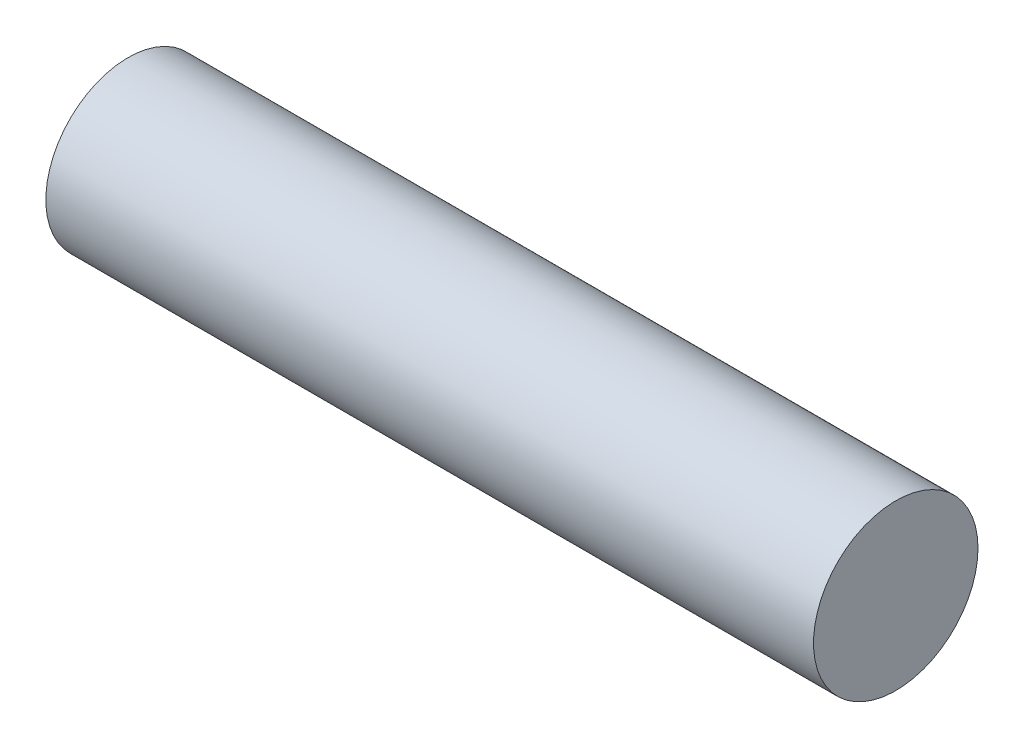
ISO-10303-21;
HEADER;
FILE_DESCRIPTION(('STEP AP214'),'2;1');
FILE_NAME('part.step','',(''),(''),'','','');
FILE_SCHEMA(('AUTOMOTIVE_DESIGN { 1 0 10303 214 1 1 1 1 }'));
ENDSEC;
DATA;
#1=APPLICATION_CONTEXT('core data for automotive mechanical design processes');
#2=APPLICATION_PROTOCOL_DEFINITION('international standard','automotive_design',2000,#1);
#3=PRODUCT_CONTEXT('',#1,'mechanical');
#4=PRODUCT('Part','Part','',(#3));
#5=PRODUCT_RELATED_PRODUCT_CATEGORY('part','',(#4));
#6=PRODUCT_DEFINITION_FORMATION('','',#4);
#7=PRODUCT_DEFINITION_CONTEXT('part definition',#1,'design');
#8=PRODUCT_DEFINITION('design','',#6,#7);
#9=PRODUCT_DEFINITION_SHAPE('','',#8);
#10=(LENGTH_UNIT() NAMED_UNIT(*) SI_UNIT(.MILLI.,.METRE.));
#11=(NAMED_UNIT(*) PLANE_ANGLE_UNIT() SI_UNIT($,.RADIAN.));
#12=(NAMED_UNIT(*) SI_UNIT($,.STERADIAN.) SOLID_ANGLE_UNIT());
#13=UNCERTAINTY_MEASURE_WITH_UNIT(LENGTH_MEASURE(1.E-05),#10,'distance_accuracy_value','');
#14=(GEOMETRIC_REPRESENTATION_CONTEXT(3) GLOBAL_UNCERTAINTY_ASSIGNED_CONTEXT((#13)) GLOBAL_UNIT_ASSIGNED_CONTEXT((#10,
#11,#12)) REPRESENTATION_CONTEXT('',''));
#15=CARTESIAN_POINT('',(0.,0.,0.));
#16=DIRECTION('',(0.,0.,1.));
#17=DIRECTION('',(1.,0.,0.));
#18=AXIS2_PLACEMENT_3D('',#15,#16,#17);
#19=CARTESIAN_POINT('',(70.,0.,0.));
#20=DIRECTION('',(-1.,0.,0.));
#21=DIRECTION('',(0.,0.,1.));
#22=AXIS2_PLACEMENT_3D('',#19,#20,#21);
#23=CYLINDRICAL_SURFACE('',#22,15.);
#24=CARTESIAN_POINT('',(70.,0.,0.));
#25=DIRECTION('',(1.,0.,0.));
#26=DIRECTION('',(0.,0.,-1.));
#27=AXIS2_PLACEMENT_3D('',#24,#25,#26);
#28=CIRCLE('',#27,15.);
#29=CARTESIAN_POINT('',(70.,0.,-15.));
#30=VERTEX_POINT('',#29);
#31=EDGE_CURVE('E10',#30,#30,#28,.T.);
#32=ORIENTED_EDGE('',*,*,#31,.F.);
#33=EDGE_LOOP('',(#32));
#34=FACE_BOUND('',#33,.T.);
#35=CARTESIAN_POINT('',(-70.,0.,0.));
#36=DIRECTION('',(1.,0.,0.));
#37=DIRECTION('',(0.,0.,-1.));
#38=AXIS2_PLACEMENT_3D('',#35,#36,#37);
#39=CIRCLE('',#38,15.);
#40=CARTESIAN_POINT('',(-70.,0.,-15.));
#41=VERTEX_POINT('',#40);
#42=EDGE_CURVE('E34',#41,#41,#39,.T.);
#43=ORIENTED_EDGE('',*,*,#42,.T.);
#44=EDGE_LOOP('',(#43));
#45=FACE_BOUND('',#44,.T.);
#46=ADVANCED_FACE('F31',(#34,#45),#23,.T.);
#47=CARTESIAN_POINT('',(70.,0.,0.));
#48=DIRECTION('',(1.,0.,0.));
#49=DIRECTION('',(0.,0.,-1.));
#50=AXIS2_PLACEMENT_3D('',#47,#48,#49);
#51=PLANE('',#50);
#52=ORIENTED_EDGE('',*,*,#31,.T.);
#53=EDGE_LOOP('',(#52));
#54=FACE_BOUND('',#53,.T.);
#55=ADVANCED_FACE('F46',(#54),#51,.T.);
#56=CARTESIAN_POINT('',(-70.,0.,0.));
#57=DIRECTION('',(1.,0.,0.));
#58=DIRECTION('',(0.,0.,-1.));
#59=AXIS2_PLACEMENT_3D('',#56,#57,#58);
#60=PLANE('',#59);
#61=ORIENTED_EDGE('',*,*,#42,.F.);
#62=EDGE_LOOP('',(#61));
#63=FACE_BOUND('',#62,.T.);
#64=ADVANCED_FACE('F44',(#63),#60,.F.);
#65=CLOSED_SHELL('',(#46,#55,#64));
#66=MANIFOLD_SOLID_BREP('B2',#65);
#67=ADVANCED_BREP_SHAPE_REPRESENTATION('',(#18,#66),#14);
#68=SHAPE_DEFINITION_REPRESENTATION(#9,#67);
ENDSEC;
END-ISO-10303-21;
